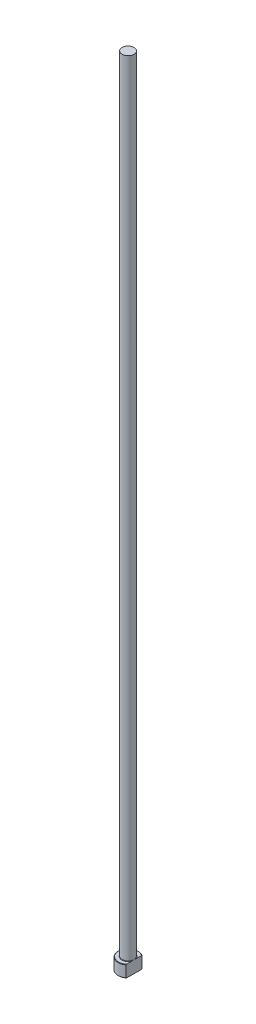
from build123d import *
from build123d.topology import SkipClean

# Parameters (mm, degrees)
CHAMFER1_SIZE    = 0.2
FILLET1_R        = 0.2
KEYED_HEAD_DEPTH = 401.062495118


with BuildPart() as part:
    # Sketch1 → Revolve1 (revolve)
    with BuildSketch(Plane.XY, mode=Mode.PRIVATE) as revolve1_sk:
        Polygon((0, 0), (-5, 0), (-5, 6), (-3, 6), (-3, 400), (0, 400), align=None)
    revolve(revolve1_sk.sketch.rotate(Axis((0, 259.958771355, 0), (0, -1, 0)), 270), axis=Axis((0, 259.958771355, 0), (0, -1, 0)))

    # Chamfer1
    chamfer1_edges = [part.edges().sort_by_distance(p)[0] for p in [
        (0, 6, -5),
        (0, 0, -5),
    ]]
    chamfer(chamfer1_edges, length=CHAMFER1_SIZE)

    # Fillet1
    fillet1_edges = [part.edges().sort_by_distance(p)[0] for p in [
        (0, 6, -3),
    ]]
    fillet(fillet1_edges, radius=FILLET1_R)

    # Sketch2 → KEYED HEAD (cut, through all)
    with SkipClean():  # the faces are left unmerged after this step: merging them gives an invalid solid
        with BuildSketch(Plane(origin=(0, 0, 0), x_dir=(1, 0, 0), z_dir=(0, 1, 0))):
            with BuildLine():
                Line((3, -4), (3, 4))
                ThreePointArc((3, 4), (5, 0), (3, -4))
            make_face()
        extrude(amount=KEYED_HEAD_DEPTH, mode=Mode.SUBTRACT)


solid = part.part
